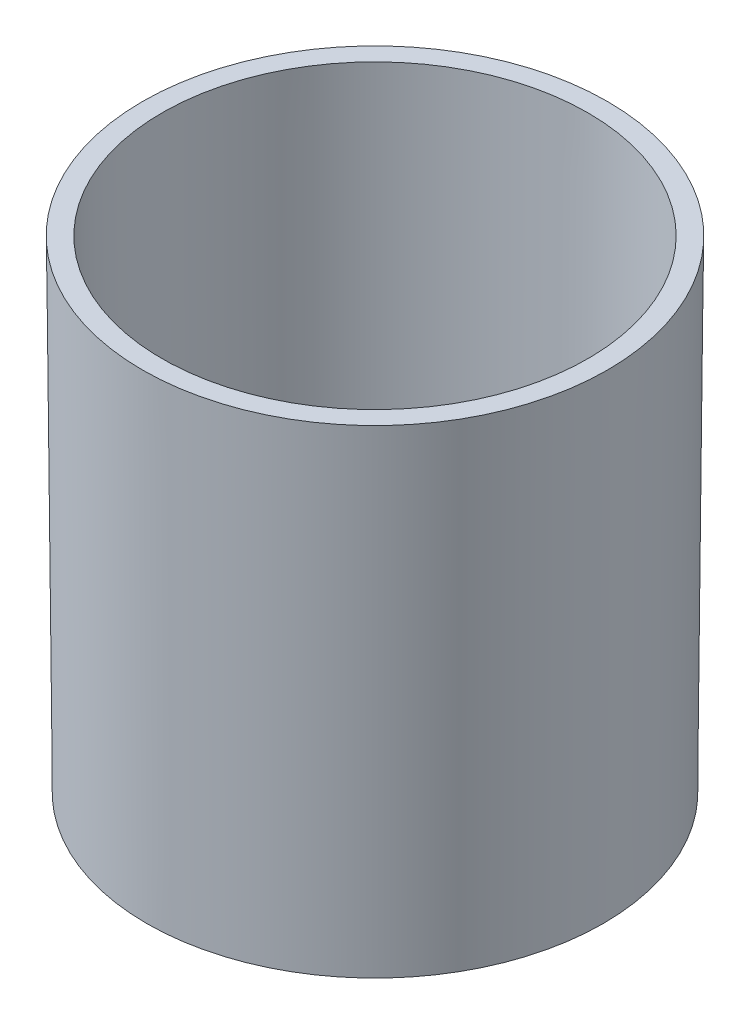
ISO-10303-21;
HEADER;
FILE_DESCRIPTION(('STEP AP214'),'2;1');
FILE_NAME('part.step','',(''),(''),'','','');
FILE_SCHEMA(('AUTOMOTIVE_DESIGN { 1 0 10303 214 1 1 1 1 }'));
ENDSEC;
DATA;
#1=APPLICATION_CONTEXT('core data for automotive mechanical design processes');
#2=APPLICATION_PROTOCOL_DEFINITION('international standard','automotive_design',2000,#1);
#3=PRODUCT_CONTEXT('',#1,'mechanical');
#4=PRODUCT('Part','Part','',(#3));
#5=PRODUCT_RELATED_PRODUCT_CATEGORY('part','',(#4));
#6=PRODUCT_DEFINITION_FORMATION('','',#4);
#7=PRODUCT_DEFINITION_CONTEXT('part definition',#1,'design');
#8=PRODUCT_DEFINITION('design','',#6,#7);
#9=PRODUCT_DEFINITION_SHAPE('','',#8);
#10=(LENGTH_UNIT() NAMED_UNIT(*) SI_UNIT(.MILLI.,.METRE.));
#11=(NAMED_UNIT(*) PLANE_ANGLE_UNIT() SI_UNIT($,.RADIAN.));
#12=(NAMED_UNIT(*) SI_UNIT($,.STERADIAN.) SOLID_ANGLE_UNIT());
#13=UNCERTAINTY_MEASURE_WITH_UNIT(LENGTH_MEASURE(1.E-05),#10,'distance_accuracy_value','');
#14=(GEOMETRIC_REPRESENTATION_CONTEXT(3) GLOBAL_UNCERTAINTY_ASSIGNED_CONTEXT((#13)) GLOBAL_UNIT_ASSIGNED_CONTEXT((#10,
#11,#12)) REPRESENTATION_CONTEXT('',''));
#15=CARTESIAN_POINT('',(0.,0.,0.));
#16=DIRECTION('',(0.,0.,1.));
#17=DIRECTION('',(1.,0.,0.));
#18=AXIS2_PLACEMENT_3D('',#15,#16,#17);
#19=CARTESIAN_POINT('',(0.,3.,0.));
#20=DIRECTION('',(0.,1.,0.));
#21=DIRECTION('',(0.,0.,1.));
#22=AXIS2_PLACEMENT_3D('',#19,#20,#21);
#23=CONICAL_SURFACE('',#22,16.0130331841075,0.0087266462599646);
#24=CARTESIAN_POINT('',(0.,38.4,0.));
#25=DIRECTION('',(0.,-1.,0.));
#26=DIRECTION('',(0.,0.,-1.));
#27=AXIS2_PLACEMENT_3D('',#24,#25,#26);
#28=CIRCLE('',#27,16.3219643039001);
#29=CARTESIAN_POINT('',(0.,38.4,-16.3219643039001));
#30=VERTEX_POINT('',#29);
#31=EDGE_CURVE('E10',#30,#30,#28,.T.);
#32=ORIENTED_EDGE('',*,*,#31,.F.);
#33=EDGE_LOOP('',(#32));
#34=FACE_BOUND('',#33,.T.);
#35=CARTESIAN_POINT('',(0.,3.,0.));
#36=DIRECTION('',(0.,-1.,0.));
#37=DIRECTION('',(0.,0.,-1.));
#38=AXIS2_PLACEMENT_3D('',#35,#36,#37);
#39=CIRCLE('',#38,16.0130331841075);
#40=CARTESIAN_POINT('',(0.,3.,-16.0130331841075));
#41=VERTEX_POINT('',#40);
#42=EDGE_CURVE('E43',#41,#41,#39,.T.);
#43=ORIENTED_EDGE('',*,*,#42,.T.);
#44=EDGE_LOOP('',(#43));
#45=FACE_BOUND('',#44,.T.);
#46=ADVANCED_FACE('F29',(#34,#45),#23,.F.);
#47=CARTESIAN_POINT('',(3.09476154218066,38.4,-17.5512648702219));
#48=DIRECTION('',(0.,-1.,0.));
#49=DIRECTION('',(0.,0.,-1.));
#50=AXIS2_PLACEMENT_3D('',#47,#48,#49);
#51=PLANE('',#50);
#52=CARTESIAN_POINT('',(0.,38.4,0.));
#53=DIRECTION('',(0.,-1.,0.));
#54=DIRECTION('',(0.,0.,-1.));
#55=AXIS2_PLACEMENT_3D('',#52,#53,#54);
#56=CIRCLE('',#55,17.8220214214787);
#57=CARTESIAN_POINT('',(0.,38.4,-17.8220214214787));
#58=VERTEX_POINT('',#57);
#59=EDGE_CURVE('E35',#58,#58,#56,.T.);
#60=ORIENTED_EDGE('',*,*,#59,.F.);
#61=EDGE_LOOP('',(#60));
#62=FACE_BOUND('',#61,.T.);
#63=ORIENTED_EDGE('',*,*,#31,.T.);
#64=EDGE_LOOP('',(#63));
#65=FACE_BOUND('',#64,.T.);
#66=ADVANCED_FACE('F61',(#62,#65),#51,.F.);
#67=CARTESIAN_POINT('',(0.,38.4,0.));
#68=DIRECTION('',(0.,1.,0.));
#69=DIRECTION('',(0.,0.,1.));
#70=AXIS2_PLACEMENT_3D('',#67,#68,#69);
#71=CONICAL_SURFACE('',#70,17.8220214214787,0.00872664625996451);
#72=CARTESIAN_POINT('',(0.,1.5,0.));
#73=DIRECTION('',(0.,-1.,0.));
#74=DIRECTION('',(0.,0.,-1.));
#75=AXIS2_PLACEMENT_3D('',#72,#73,#74);
#76=CIRCLE('',#75,17.5);
#77=CARTESIAN_POINT('',(0.,1.5,-17.5));
#78=VERTEX_POINT('',#77);
#79=EDGE_CURVE('E39',#78,#78,#76,.T.);
#80=ORIENTED_EDGE('',*,*,#79,.F.);
#81=EDGE_LOOP('',(#80));
#82=FACE_BOUND('',#81,.T.);
#83=ORIENTED_EDGE('',*,*,#59,.T.);
#84=EDGE_LOOP('',(#83));
#85=FACE_BOUND('',#84,.T.);
#86=ADVANCED_FACE('F57',(#82,#85),#71,.T.);
#87=CARTESIAN_POINT('',(3.03884310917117,1.5,-17.2341356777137));
#88=DIRECTION('',(0.,1.,0.));
#89=DIRECTION('',(0.,0.,1.));
#90=AXIS2_PLACEMENT_3D('',#87,#88,#89);
#91=PLANE('',#90);
#92=ORIENTED_EDGE('',*,*,#79,.T.);
#93=EDGE_LOOP('',(#92));
#94=FACE_BOUND('',#93,.T.);
#95=ADVANCED_FACE('F52',(#94),#91,.F.);
#96=CARTESIAN_POINT('',(2.78063403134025,3.,-15.7697592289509));
#97=DIRECTION('',(0.,-1.,0.));
#98=DIRECTION('',(0.,0.,-1.));
#99=AXIS2_PLACEMENT_3D('',#96,#97,#98);
#100=PLANE('',#99);
#101=ORIENTED_EDGE('',*,*,#42,.F.);
#102=EDGE_LOOP('',(#101));
#103=FACE_BOUND('',#102,.T.);
#104=ADVANCED_FACE('F50',(#103),#100,.F.);
#105=CLOSED_SHELL('',(#46,#66,#86,#95,#104));
#106=MANIFOLD_SOLID_BREP('B2',#105);
#107=ADVANCED_BREP_SHAPE_REPRESENTATION('',(#18,#106),#14);
#108=SHAPE_DEFINITION_REPRESENTATION(#9,#107);
ENDSEC;
END-ISO-10303-21;
